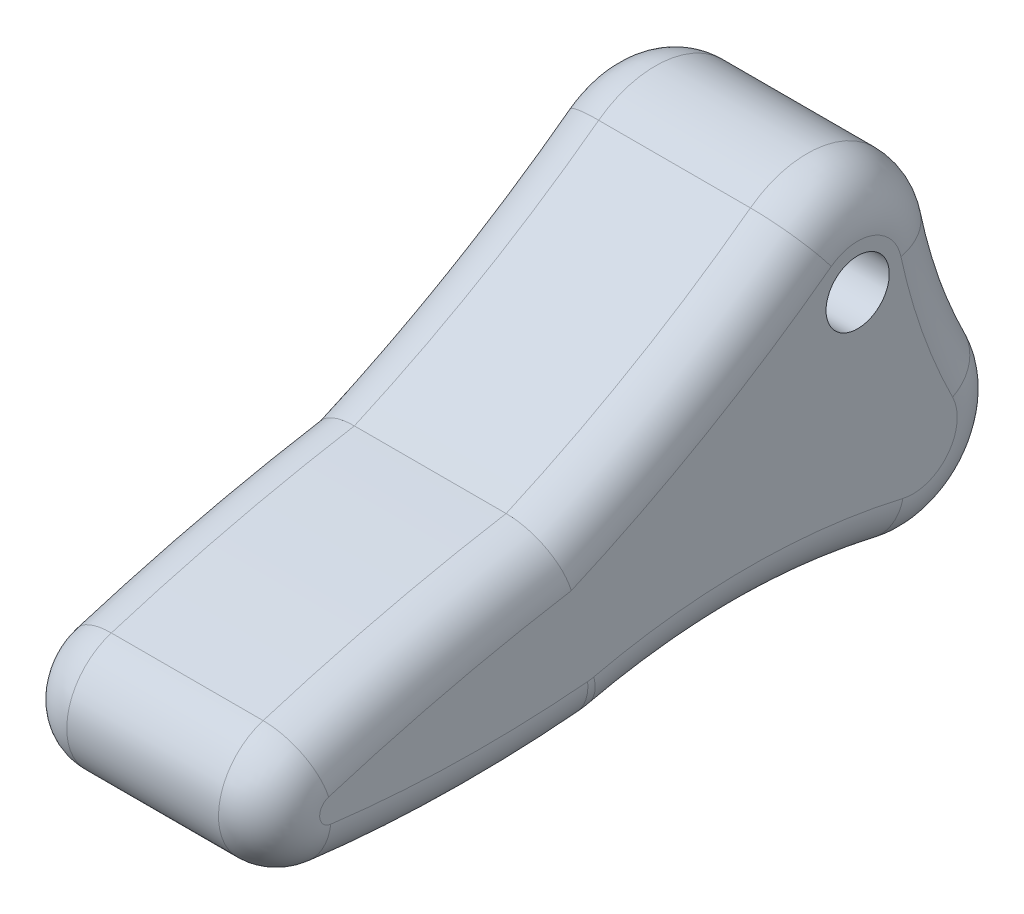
from build123d import *

# Parameters (mm, degrees)
BASE_EXTRUDE_DEPTH  = 50.8
BOSS_EXTRUDE1_DEPTH = 50.8
FILLET1_R           = 20.32
SKETCH13_R          = 12.7
CUT_EXTRUDE1_DEPTH  = 278.313526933


with BuildPart() as part:
    # Sketch11 → Base-Extrude (new, symmetric)
    with BuildSketch(Plane(origin=(0, 0, 0), x_dir=(0, 0, -1), z_dir=(1, 0, 0))):
        with BuildLine():
            ThreePointArc((37.262513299, 7.944501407), (13.432280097, 35.653665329), (-22.757469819, 30.556628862))
            ThreePointArc((-22.757469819, 30.556628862), (-72.190400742, -1.962558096), (-125.06930822, -28.51313858))
            ThreePointArc((-125.06930822, -28.51313858), (-146.179018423, -75.400395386), (-101.363553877, -100.61167963))
            ThreePointArc((-101.363553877, -100.61167963), (-43.885737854, -94.022877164), (13.592078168, -100.61167963))
            ThreePointArc((13.592078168, -100.61167963), (52.123569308, -87.101117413), (56.302870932, -46.484070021))
            ThreePointArc((56.302870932, -46.484070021), (45.059656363, -19.872541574), (37.262513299, 7.944501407))
        make_face()
    extrude(amount=BASE_EXTRUDE_DEPTH, both=True)

    # Sketch12 → Boss-Extrude1 (add, symmetric)
    with BuildSketch(Plane(origin=(0, 0, 0), x_dir=(0, 0, -1), z_dir=(1, 0, 0))):
        with BuildLine():
            ThreePointArc((-106.68342645, -101.456661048), (-72.177935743, -58.786319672), (-116.104241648, -25.894579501))
            ThreePointArc((-116.104241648, -25.894579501), (-167.724563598, -36.135224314), (-218.51494553, -49.914395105))
            ThreePointArc((-218.51494553, -49.914395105), (-236.325679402, -76.392939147), (-214.196358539, -99.384865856))
            ThreePointArc((-214.196358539, -99.384865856), (-160.494866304, -103.273552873), (-106.68342645, -101.456661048))
        make_face()
    extrude(amount=BOSS_EXTRUDE1_DEPTH, both=True)

    # Fillet1
    fillet1_edges = [part.edges().sort_by_distance(p)[0] for p in [
        (-50.8, -87.101117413, -52.123569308),
        (50.8, -87.101117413, -52.123569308),
        (-50.8, -94.022877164, 43.885737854),
        (-50.8, -19.872541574, -45.059656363),
        (-50.8, 35.653665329, -13.432280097),
        (-50.8, -0.818056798, 70.218300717),
        (-50.8, -36.692842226, 170.085113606),
        (-50.8, -76.392939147, 236.325679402),
        (-50.8, -103.273552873, 160.494866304),
        (-50.8, -101.128303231, 104.008538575),
        (50.8, -19.872541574, -45.059656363),
        (50.8, -94.022877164, 43.885737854),
        (50.8, 35.653665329, -13.432280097),
        (50.8, -0.818056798, 70.218300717),
        (50.8, -36.692842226, 170.085113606),
        (50.8, -76.392939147, 236.325679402),
        (50.8, -103.273552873, 160.494866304),
        (50.8, -101.128303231, 104.008538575),
    ]]
    fillet(fillet1_edges, radius=FILLET1_R)

    # Sketch13 → Cut-Extrude1 (cut, through all)
    with BuildSketch(Plane.ZY.offset(50.8)):
        Circle(SKETCH13_R)
    extrude(amount=-CUT_EXTRUDE1_DEPTH, mode=Mode.SUBTRACT)


solid = part.part
